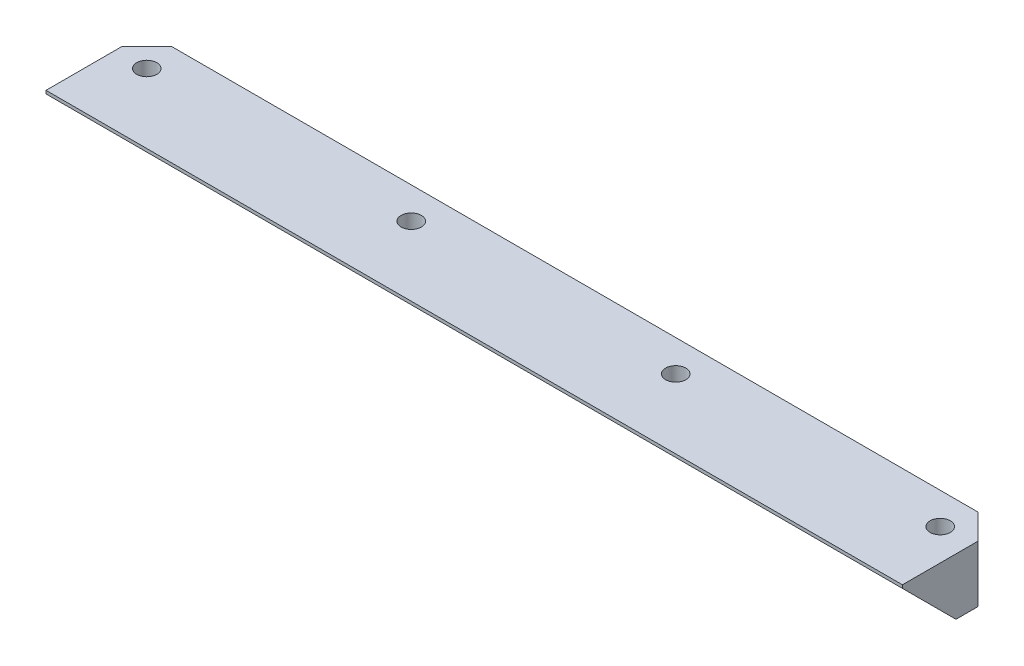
from build123d import *

# Parameters (mm, degrees)
BOSS_EXTRUDE1_DEPTH     = 107.95
CHAMFER1_SIZE           = 6.35
F_1_4_20_TAPPED_HOLE1_D = 5.1054


with BuildPart() as part:
    # Sketch1 → Boss-Extrude1 (new, symmetric)
    with BuildSketch(Plane(origin=(0, 0, 0), x_dir=(0, 0, -1), z_dir=(1, 0, 0))):
        Polygon((0, 0), (-11.90625, 0), (-25.4, 13.49375), (-25.4, 14.2875), (0, 14.2875), align=None)
    extrude(amount=BOSS_EXTRUDE1_DEPTH, both=True)

    # Chamfer1
    chamfer1_edges = [part.edges().sort_by_distance(p)[0] for p in [
        (107.95, 7.14375, 0),
        (-107.95, 7.14375, 0),
    ]]
    chamfer(chamfer1_edges, length=CHAMFER1_SIZE)

    # 1_4-20 Tapped Hole1 (through all)
    with Locations(Plane(origin=(0, 14.2875, 0), x_dir=(1, 0, 0), z_dir=(0, 1, 0))):
        with Locations((-100.0125, -7.9375), (-33.3375, -7.9375), (33.3375, -7.9375), (100.0125, -7.9375)):
            Hole(F_1_4_20_TAPPED_HOLE1_D / 2)


solid = part.part
